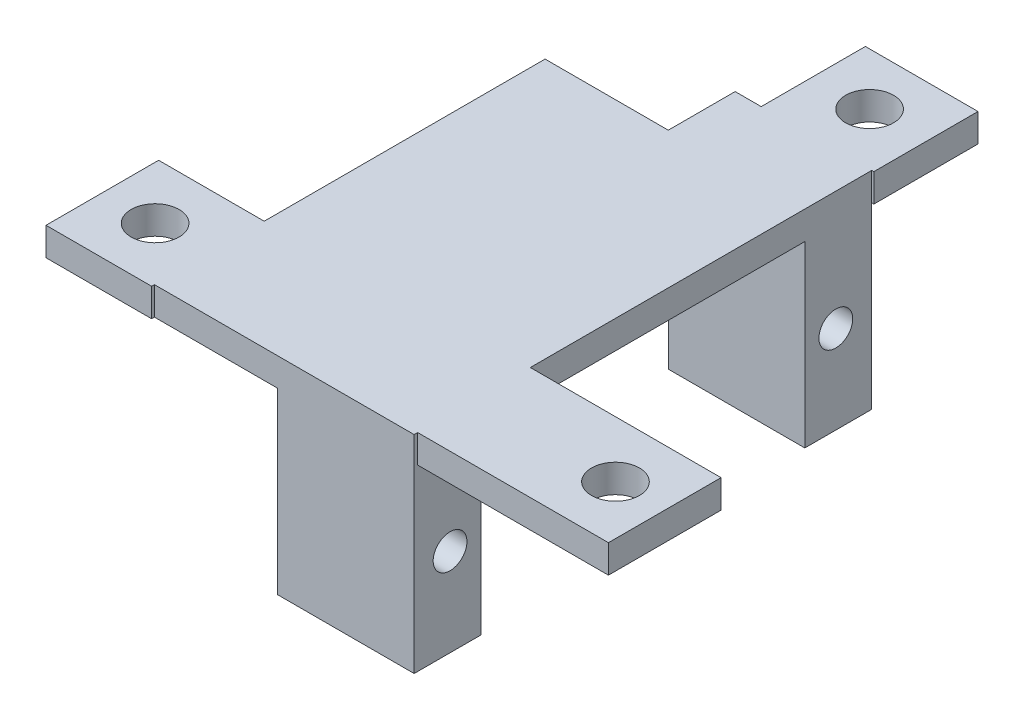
ISO-10303-21;
HEADER;
FILE_DESCRIPTION(('STEP AP214'),'2;1');
FILE_NAME('part.step','',(''),(''),'','','');
FILE_SCHEMA(('AUTOMOTIVE_DESIGN { 1 0 10303 214 1 1 1 1 }'));
ENDSEC;
DATA;
#1=APPLICATION_CONTEXT('core data for automotive mechanical design processes');
#2=APPLICATION_PROTOCOL_DEFINITION('international standard','automotive_design',2000,#1);
#3=PRODUCT_CONTEXT('',#1,'mechanical');
#4=PRODUCT('Part','Part','',(#3));
#5=PRODUCT_RELATED_PRODUCT_CATEGORY('part','',(#4));
#6=PRODUCT_DEFINITION_FORMATION('','',#4);
#7=PRODUCT_DEFINITION_CONTEXT('part definition',#1,'design');
#8=PRODUCT_DEFINITION('design','',#6,#7);
#9=PRODUCT_DEFINITION_SHAPE('','',#8);
#10=(LENGTH_UNIT() NAMED_UNIT(*) SI_UNIT(.MILLI.,.METRE.));
#11=(NAMED_UNIT(*) PLANE_ANGLE_UNIT() SI_UNIT($,.RADIAN.));
#12=(NAMED_UNIT(*) SI_UNIT($,.STERADIAN.) SOLID_ANGLE_UNIT());
#13=UNCERTAINTY_MEASURE_WITH_UNIT(LENGTH_MEASURE(1.E-05),#10,'distance_accuracy_value','');
#14=(GEOMETRIC_REPRESENTATION_CONTEXT(3) GLOBAL_UNCERTAINTY_ASSIGNED_CONTEXT((#13)) GLOBAL_UNIT_ASSIGNED_CONTEXT((#10,
#11,#12)) REPRESENTATION_CONTEXT('',''));
#15=CARTESIAN_POINT('',(0.,0.,0.));
#16=DIRECTION('',(0.,0.,1.));
#17=DIRECTION('',(1.,0.,0.));
#18=AXIS2_PLACEMENT_3D('',#15,#16,#17);
#19=CARTESIAN_POINT('',(0.,0.,0.));
#20=DIRECTION('',(0.,1.,0.));
#21=DIRECTION('',(0.,0.,1.));
#22=AXIS2_PLACEMENT_3D('',#19,#20,#21);
#23=PLANE('',#22);
#24=CARTESIAN_POINT('',(11.,0.,12.));
#25=DIRECTION('',(0.,1.,0.));
#26=DIRECTION('',(0.,0.,1.));
#27=AXIS2_PLACEMENT_3D('',#24,#25,#26);
#28=CIRCLE('',#27,1.7);
#29=CARTESIAN_POINT('',(11.,0.,13.7));
#30=VERTEX_POINT('',#29);
#31=EDGE_CURVE('E297',#30,#30,#28,.T.);
#32=ORIENTED_EDGE('',*,*,#31,.T.);
#33=EDGE_LOOP('',(#32));
#34=FACE_BOUND('',#33,.T.);
#35=CARTESIAN_POINT('',(-21.25,0.,12.45));
#36=DIRECTION('',(0.,1.,0.));
#37=DIRECTION('',(0.,0.,1.));
#38=AXIS2_PLACEMENT_3D('',#35,#36,#37);
#39=CIRCLE('',#38,1.7);
#40=CARTESIAN_POINT('',(-21.25,0.,14.15));
#41=VERTEX_POINT('',#40);
#42=EDGE_CURVE('E855',#41,#41,#39,.T.);
#43=ORIENTED_EDGE('',*,*,#42,.T.);
#44=EDGE_LOOP('',(#43));
#45=FACE_BOUND('',#44,.T.);
#46=DIRECTION('',(0.,0.,-1.));
#47=VECTOR('',#46,1.);
#48=CARTESIAN_POINT('',(-8.75,0.,0.));
#49=LINE('',#48,#47);
#50=CARTESIAN_POINT('',(-8.75,0.,16.25));
#51=VERTEX_POINT('',#50);
#52=CARTESIAN_POINT('',(-8.75,0.,11.5));
#53=VERTEX_POINT('',#52);
#54=EDGE_CURVE('E282',#51,#53,#49,.T.);
#55=ORIENTED_EDGE('',*,*,#54,.F.);
#56=DIRECTION('',(1.,0.,0.));
#57=VECTOR('',#56,1.);
#58=CARTESIAN_POINT('',(0.,0.,16.25));
#59=LINE('',#58,#57);
#60=CARTESIAN_POINT('',(-17.5,0.,16.25));
#61=VERTEX_POINT('',#60);
#62=EDGE_CURVE('E197',#61,#51,#59,.T.);
#63=ORIENTED_EDGE('',*,*,#62,.F.);
#64=DIRECTION('',(0.,0.,-1.));
#65=VECTOR('',#64,1.);
#66=CARTESIAN_POINT('',(-17.5,0.,0.));
#67=LINE('',#66,#65);
#68=CARTESIAN_POINT('',(-17.5,0.,16.45));
#69=VERTEX_POINT('',#68);
#70=EDGE_CURVE('E194',#69,#61,#67,.T.);
#71=ORIENTED_EDGE('',*,*,#70,.F.);
#72=DIRECTION('',(-1.,0.,0.));
#73=VECTOR('',#72,1.);
#74=CARTESIAN_POINT('',(0.,0.,16.45));
#75=LINE('',#74,#73);
#76=CARTESIAN_POINT('',(-25.,0.,16.45));
#77=VERTEX_POINT('',#76);
#78=EDGE_CURVE('E192',#69,#77,#75,.T.);
#79=ORIENTED_EDGE('',*,*,#78,.T.);
#80=DIRECTION('',(0.,0.,-1.));
#81=VECTOR('',#80,1.);
#82=CARTESIAN_POINT('',(-25.,0.,0.));
#83=LINE('',#82,#81);
#84=CARTESIAN_POINT('',(-25.,0.,8.45));
#85=VERTEX_POINT('',#84);
#86=EDGE_CURVE('E229',#77,#85,#83,.T.);
#87=ORIENTED_EDGE('',*,*,#86,.T.);
#88=DIRECTION('',(1.,0.,0.));
#89=VECTOR('',#88,1.);
#90=CARTESIAN_POINT('',(0.,0.,8.45));
#91=LINE('',#90,#89);
#92=CARTESIAN_POINT('',(-17.5,0.,8.45));
#93=VERTEX_POINT('',#92);
#94=EDGE_CURVE('E227',#85,#93,#91,.T.);
#95=ORIENTED_EDGE('',*,*,#94,.T.);
#96=DIRECTION('',(0.,0.,-1.));
#97=VECTOR('',#96,1.);
#98=CARTESIAN_POINT('',(-17.5,0.,0.));
#99=LINE('',#98,#97);
#100=CARTESIAN_POINT('',(-17.5,0.,-11.5));
#101=VERTEX_POINT('',#100);
#102=EDGE_CURVE('E168',#93,#101,#99,.T.);
#103=ORIENTED_EDGE('',*,*,#102,.T.);
#104=DIRECTION('',(-1.,0.,0.));
#105=VECTOR('',#104,1.);
#106=CARTESIAN_POINT('',(0.,0.,-11.5));
#107=LINE('',#106,#105);
#108=CARTESIAN_POINT('',(-8.75,0.,-11.5));
#109=VERTEX_POINT('',#108);
#110=EDGE_CURVE('E223',#109,#101,#107,.T.);
#111=ORIENTED_EDGE('',*,*,#110,.F.);
#112=DIRECTION('',(1.,0.,0.));
#113=VECTOR('',#112,1.);
#114=CARTESIAN_POINT('',(0.,0.,-11.5));
#115=LINE('',#114,#113);
#116=CARTESIAN_POINT('',(0.950000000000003,0.,-11.5));
#117=VERTEX_POINT('',#116);
#118=EDGE_CURVE('E317',#109,#117,#115,.T.);
#119=ORIENTED_EDGE('',*,*,#118,.T.);
#120=DIRECTION('',(0.,0.,1.));
#121=VECTOR('',#120,1.);
#122=CARTESIAN_POINT('',(0.950000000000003,0.,0.));
#123=LINE('',#122,#121);
#124=CARTESIAN_POINT('',(0.950000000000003,0.,8.));
#125=VERTEX_POINT('',#124);
#126=EDGE_CURVE('E209',#117,#125,#123,.T.);
#127=ORIENTED_EDGE('',*,*,#126,.T.);
#128=DIRECTION('',(1.,0.,0.));
#129=VECTOR('',#128,1.);
#130=CARTESIAN_POINT('',(0.,0.,8.));
#131=LINE('',#130,#129);
#132=CARTESIAN_POINT('',(14.5,0.,8.));
#133=VERTEX_POINT('',#132);
#134=EDGE_CURVE('E206',#125,#133,#131,.T.);
#135=ORIENTED_EDGE('',*,*,#134,.T.);
#136=DIRECTION('',(0.,0.,1.));
#137=VECTOR('',#136,1.);
#138=CARTESIAN_POINT('',(14.5,0.,0.));
#139=LINE('',#138,#137);
#140=CARTESIAN_POINT('',(14.5,0.,16.));
#141=VERTEX_POINT('',#140);
#142=EDGE_CURVE('E203',#133,#141,#139,.T.);
#143=ORIENTED_EDGE('',*,*,#142,.T.);
#144=DIRECTION('',(-1.,0.,0.));
#145=VECTOR('',#144,1.);
#146=CARTESIAN_POINT('',(0.,0.,16.));
#147=LINE('',#146,#145);
#148=CARTESIAN_POINT('',(0.950000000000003,0.,16.));
#149=VERTEX_POINT('',#148);
#150=EDGE_CURVE('E200',#141,#149,#147,.T.);
#151=ORIENTED_EDGE('',*,*,#150,.T.);
#152=DIRECTION('',(0.,0.,1.));
#153=VECTOR('',#152,1.);
#154=CARTESIAN_POINT('',(0.950000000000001,0.,0.));
#155=LINE('',#154,#153);
#156=CARTESIAN_POINT('',(0.950000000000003,0.,11.5));
#157=VERTEX_POINT('',#156);
#158=EDGE_CURVE('E294',#157,#149,#155,.T.);
#159=ORIENTED_EDGE('',*,*,#158,.F.);
#160=DIRECTION('',(1.,0.,0.));
#161=VECTOR('',#160,1.);
#162=CARTESIAN_POINT('',(0.,0.,11.5));
#163=LINE('',#162,#161);
#164=EDGE_CURVE('E286',#53,#157,#163,.T.);
#165=ORIENTED_EDGE('',*,*,#164,.F.);
#166=EDGE_LOOP('',(#55,#63,#71,#79,#87,#95,#103,#111,#119,#127,#135,#143,#151,#159,#165));
#167=FACE_BOUND('',#166,.T.);
#168=ADVANCED_FACE('F41',(#34,#45,#167),#23,.F.);
#169=CARTESIAN_POINT('',(-2.9,0.,-19.95));
#170=DIRECTION('',(0.,1.,0.));
#171=DIRECTION('',(0.,0.,1.));
#172=AXIS2_PLACEMENT_3D('',#169,#170,#171);
#173=CIRCLE('',#172,1.7);
#174=CARTESIAN_POINT('',(-2.9,0.,-18.25));
#175=VERTEX_POINT('',#174);
#176=EDGE_CURVE('E292',#175,#175,#173,.T.);
#177=ORIENTED_EDGE('',*,*,#176,.T.);
#178=EDGE_LOOP('',(#177));
#179=FACE_BOUND('',#178,.T.);
#180=DIRECTION('',(1.,0.,0.));
#181=VECTOR('',#180,1.);
#182=CARTESIAN_POINT('',(0.,0.,-16.25));
#183=LINE('',#182,#181);
#184=CARTESIAN_POINT('',(0.949999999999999,0.,-16.25));
#185=VERTEX_POINT('',#184);
#186=CARTESIAN_POINT('',(1.1,0.,-16.25));
#187=VERTEX_POINT('',#186);
#188=EDGE_CURVE('E211',#185,#187,#183,.T.);
#189=ORIENTED_EDGE('',*,*,#188,.F.);
#190=DIRECTION('',(-1.,0.,0.));
#191=VECTOR('',#190,1.);
#192=CARTESIAN_POINT('',(0.,0.,-16.25));
#193=LINE('',#192,#191);
#194=CARTESIAN_POINT('',(-6.9,0.,-16.25));
#195=VERTEX_POINT('',#194);
#196=EDGE_CURVE('E312',#185,#195,#193,.T.);
#197=ORIENTED_EDGE('',*,*,#196,.T.);
#198=DIRECTION('',(0.,0.,-1.));
#199=VECTOR('',#198,1.);
#200=CARTESIAN_POINT('',(-6.9,0.,0.));
#201=LINE('',#200,#199);
#202=CARTESIAN_POINT('',(-6.9,0.,-23.65));
#203=VERTEX_POINT('',#202);
#204=EDGE_CURVE('E220',#195,#203,#201,.T.);
#205=ORIENTED_EDGE('',*,*,#204,.T.);
#206=DIRECTION('',(1.,0.,0.));
#207=VECTOR('',#206,1.);
#208=CARTESIAN_POINT('',(0.,0.,-23.65));
#209=LINE('',#208,#207);
#210=CARTESIAN_POINT('',(1.1,0.,-23.65));
#211=VERTEX_POINT('',#210);
#212=EDGE_CURVE('E217',#203,#211,#209,.T.);
#213=ORIENTED_EDGE('',*,*,#212,.T.);
#214=DIRECTION('',(0.,0.,1.));
#215=VECTOR('',#214,1.);
#216=CARTESIAN_POINT('',(1.1,0.,0.));
#217=LINE('',#216,#215);
#218=EDGE_CURVE('E214',#211,#187,#217,.T.);
#219=ORIENTED_EDGE('',*,*,#218,.T.);
#220=EDGE_LOOP('',(#189,#197,#205,#213,#219));
#221=FACE_BOUND('',#220,.T.);
#222=ADVANCED_FACE('F382',(#179,#221),#23,.F.);
#223=CARTESIAN_POINT('',(0.,2.,16.45));
#224=DIRECTION('',(0.,0.,1.));
#225=DIRECTION('',(1.,0.,0.));
#226=AXIS2_PLACEMENT_3D('',#223,#224,#225);
#227=PLANE('',#226);
#228=ORIENTED_EDGE('',*,*,#78,.F.);
#229=DIRECTION('',(0.,-1.,0.));
#230=VECTOR('',#229,1.);
#231=CARTESIAN_POINT('',(-17.5,2.,16.45));
#232=LINE('',#231,#230);
#233=CARTESIAN_POINT('',(-17.5,2.,16.45));
#234=VERTEX_POINT('',#233);
#235=EDGE_CURVE('E11',#234,#69,#232,.T.);
#236=ORIENTED_EDGE('',*,*,#235,.F.);
#237=DIRECTION('',(-1.,0.,0.));
#238=VECTOR('',#237,1.);
#239=CARTESIAN_POINT('',(0.,2.,16.45));
#240=LINE('',#239,#238);
#241=CARTESIAN_POINT('',(-25.,2.,16.45));
#242=VERTEX_POINT('',#241);
#243=EDGE_CURVE('E232',#234,#242,#240,.T.);
#244=ORIENTED_EDGE('',*,*,#243,.T.);
#245=DIRECTION('',(0.,-1.,0.));
#246=VECTOR('',#245,1.);
#247=CARTESIAN_POINT('',(-25.,2.,16.45));
#248=LINE('',#247,#246);
#249=EDGE_CURVE('E65',#242,#77,#248,.T.);
#250=ORIENTED_EDGE('',*,*,#249,.T.);
#251=EDGE_LOOP('',(#228,#236,#244,#250));
#252=FACE_BOUND('',#251,.T.);
#253=ADVANCED_FACE('F43',(#252),#227,.T.);
#254=CARTESIAN_POINT('',(-17.5,2.,0.));
#255=DIRECTION('',(-1.,0.,0.));
#256=DIRECTION('',(0.,0.,1.));
#257=AXIS2_PLACEMENT_3D('',#254,#255,#256);
#258=PLANE('',#257);
#259=ORIENTED_EDGE('',*,*,#70,.T.);
#260=DIRECTION('',(0.,-1.,0.));
#261=VECTOR('',#260,1.);
#262=CARTESIAN_POINT('',(-17.5,2.,16.25));
#263=LINE('',#262,#261);
#264=CARTESIAN_POINT('',(-17.5,2.,16.25));
#265=VERTEX_POINT('',#264);
#266=EDGE_CURVE('E49',#265,#61,#263,.T.);
#267=ORIENTED_EDGE('',*,*,#266,.F.);
#268=DIRECTION('',(0.,0.,-1.));
#269=VECTOR('',#268,1.);
#270=CARTESIAN_POINT('',(-17.5,2.,0.));
#271=LINE('',#270,#269);
#272=EDGE_CURVE('E335',#234,#265,#271,.T.);
#273=ORIENTED_EDGE('',*,*,#272,.F.);
#274=ORIENTED_EDGE('',*,*,#235,.T.);
#275=EDGE_LOOP('',(#259,#267,#273,#274));
#276=FACE_BOUND('',#275,.T.);
#277=ADVANCED_FACE('F381',(#276),#258,.F.);
#278=CARTESIAN_POINT('',(0.,2.,16.25));
#279=DIRECTION('',(0.,0.,-1.));
#280=DIRECTION('',(-1.,0.,0.));
#281=AXIS2_PLACEMENT_3D('',#278,#279,#280);
#282=PLANE('',#281);
#283=ORIENTED_EDGE('',*,*,#62,.T.);
#284=DIRECTION('',(0.,1.,0.));
#285=VECTOR('',#284,1.);
#286=CARTESIAN_POINT('',(-8.75,-12.7,16.25));
#287=LINE('',#286,#285);
#288=CARTESIAN_POINT('',(-8.75,-12.7,16.25));
#289=VERTEX_POINT('',#288);
#290=EDGE_CURVE('E310',#289,#51,#287,.T.);
#291=ORIENTED_EDGE('',*,*,#290,.F.);
#292=DIRECTION('',(-1.,0.,0.));
#293=VECTOR('',#292,1.);
#294=CARTESIAN_POINT('',(0.,-12.7,16.25));
#295=LINE('',#294,#293);
#296=CARTESIAN_POINT('',(0.950000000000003,-12.7,16.25));
#297=VERTEX_POINT('',#296);
#298=EDGE_CURVE('E304',#297,#289,#295,.T.);
#299=ORIENTED_EDGE('',*,*,#298,.F.);
#300=DIRECTION('',(0.,-1.,0.));
#301=VECTOR('',#300,1.);
#302=CARTESIAN_POINT('',(0.950000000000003,2.,16.25));
#303=LINE('',#302,#301);
#304=CARTESIAN_POINT('',(0.950000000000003,2.,16.25));
#305=VERTEX_POINT('',#304);
#306=EDGE_CURVE('E264',#305,#297,#303,.T.);
#307=ORIENTED_EDGE('',*,*,#306,.F.);
#308=DIRECTION('',(1.,0.,0.));
#309=VECTOR('',#308,1.);
#310=CARTESIAN_POINT('',(0.,2.,16.25));
#311=LINE('',#310,#309);
#312=EDGE_CURVE('E275',#265,#305,#311,.T.);
#313=ORIENTED_EDGE('',*,*,#312,.F.);
#314=ORIENTED_EDGE('',*,*,#266,.T.);
#315=EDGE_LOOP('',(#283,#291,#299,#307,#313,#314));
#316=FACE_BOUND('',#315,.T.);
#317=ADVANCED_FACE('F271',(#316),#282,.F.);
#318=CARTESIAN_POINT('',(0.950000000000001,2.,0.));
#319=DIRECTION('',(-1.,0.,0.));
#320=DIRECTION('',(0.,0.,1.));
#321=AXIS2_PLACEMENT_3D('',#318,#319,#320);
#322=PLANE('',#321);
#323=CARTESIAN_POINT('',(0.950000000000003,-6.45,13.7));
#324=DIRECTION('',(-1.,0.,0.));
#325=DIRECTION('',(0.,0.,1.));
#326=AXIS2_PLACEMENT_3D('',#323,#324,#325);
#327=CIRCLE('',#326,1.2);
#328=CARTESIAN_POINT('',(0.950000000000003,-6.45,14.9));
#329=VERTEX_POINT('',#328);
#330=EDGE_CURVE('E838',#329,#329,#327,.T.);
#331=ORIENTED_EDGE('',*,*,#330,.T.);
#332=EDGE_LOOP('',(#331));
#333=FACE_BOUND('',#332,.T.);
#334=ORIENTED_EDGE('',*,*,#306,.T.);
#335=DIRECTION('',(0.,0.,1.));
#336=VECTOR('',#335,1.);
#337=CARTESIAN_POINT('',(0.950000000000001,-12.7,0.));
#338=LINE('',#337,#336);
#339=CARTESIAN_POINT('',(0.950000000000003,-12.7,11.5));
#340=VERTEX_POINT('',#339);
#341=EDGE_CURVE('E300',#340,#297,#338,.T.);
#342=ORIENTED_EDGE('',*,*,#341,.F.);
#343=DIRECTION('',(0.,1.,0.));
#344=VECTOR('',#343,1.);
#345=CARTESIAN_POINT('',(0.950000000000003,-12.7,11.5));
#346=LINE('',#345,#344);
#347=EDGE_CURVE('E305',#340,#157,#346,.T.);
#348=ORIENTED_EDGE('',*,*,#347,.T.);
#349=ORIENTED_EDGE('',*,*,#158,.T.);
#350=DIRECTION('',(0.,-1.,0.));
#351=VECTOR('',#350,1.);
#352=CARTESIAN_POINT('',(0.950000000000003,2.,16.));
#353=LINE('',#352,#351);
#354=CARTESIAN_POINT('',(0.950000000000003,2.,16.));
#355=VERTEX_POINT('',#354);
#356=EDGE_CURVE('E261',#355,#149,#353,.T.);
#357=ORIENTED_EDGE('',*,*,#356,.F.);
#358=DIRECTION('',(0.,0.,-1.));
#359=VECTOR('',#358,1.);
#360=CARTESIAN_POINT('',(0.950000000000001,2.,0.));
#361=LINE('',#360,#359);
#362=EDGE_CURVE('E338',#305,#355,#361,.T.);
#363=ORIENTED_EDGE('',*,*,#362,.F.);
#364=EDGE_LOOP('',(#334,#342,#348,#349,#357,#363));
#365=FACE_BOUND('',#364,.T.);
#366=ADVANCED_FACE('F443',(#333,#365),#322,.F.);
#367=CARTESIAN_POINT('',(0.,2.,16.));
#368=DIRECTION('',(0.,0.,1.));
#369=DIRECTION('',(1.,0.,0.));
#370=AXIS2_PLACEMENT_3D('',#367,#368,#369);
#371=PLANE('',#370);
#372=ORIENTED_EDGE('',*,*,#150,.F.);
#373=DIRECTION('',(0.,-1.,0.));
#374=VECTOR('',#373,1.);
#375=CARTESIAN_POINT('',(14.5,2.,16.));
#376=LINE('',#375,#374);
#377=CARTESIAN_POINT('',(14.5,2.,16.));
#378=VERTEX_POINT('',#377);
#379=EDGE_CURVE('E259',#378,#141,#376,.T.);
#380=ORIENTED_EDGE('',*,*,#379,.F.);
#381=DIRECTION('',(-1.,0.,0.));
#382=VECTOR('',#381,1.);
#383=CARTESIAN_POINT('',(0.,2.,16.));
#384=LINE('',#383,#382);
#385=EDGE_CURVE('E340',#378,#355,#384,.T.);
#386=ORIENTED_EDGE('',*,*,#385,.T.);
#387=ORIENTED_EDGE('',*,*,#356,.T.);
#388=EDGE_LOOP('',(#372,#380,#386,#387));
#389=FACE_BOUND('',#388,.T.);
#390=ADVANCED_FACE('F439',(#389),#371,.T.);
#391=CARTESIAN_POINT('',(14.5,2.,0.));
#392=DIRECTION('',(1.,0.,0.));
#393=DIRECTION('',(0.,0.,-1.));
#394=AXIS2_PLACEMENT_3D('',#391,#392,#393);
#395=PLANE('',#394);
#396=ORIENTED_EDGE('',*,*,#142,.F.);
#397=DIRECTION('',(0.,-1.,0.));
#398=VECTOR('',#397,1.);
#399=CARTESIAN_POINT('',(14.5,2.,8.));
#400=LINE('',#399,#398);
#401=CARTESIAN_POINT('',(14.5,2.,8.));
#402=VERTEX_POINT('',#401);
#403=EDGE_CURVE('E257',#402,#133,#400,.T.);
#404=ORIENTED_EDGE('',*,*,#403,.F.);
#405=DIRECTION('',(0.,0.,1.));
#406=VECTOR('',#405,1.);
#407=CARTESIAN_POINT('',(14.5,2.,0.));
#408=LINE('',#407,#406);
#409=EDGE_CURVE('E343',#402,#378,#408,.T.);
#410=ORIENTED_EDGE('',*,*,#409,.T.);
#411=ORIENTED_EDGE('',*,*,#379,.T.);
#412=EDGE_LOOP('',(#396,#404,#410,#411));
#413=FACE_BOUND('',#412,.T.);
#414=ADVANCED_FACE('F435',(#413),#395,.T.);
#415=CARTESIAN_POINT('',(0.,2.,8.));
#416=DIRECTION('',(0.,0.,-1.));
#417=DIRECTION('',(-1.,0.,0.));
#418=AXIS2_PLACEMENT_3D('',#415,#416,#417);
#419=PLANE('',#418);
#420=ORIENTED_EDGE('',*,*,#134,.F.);
#421=DIRECTION('',(0.,-1.,0.));
#422=VECTOR('',#421,1.);
#423=CARTESIAN_POINT('',(0.950000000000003,2.,8.));
#424=LINE('',#423,#422);
#425=CARTESIAN_POINT('',(0.950000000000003,2.,8.));
#426=VERTEX_POINT('',#425);
#427=EDGE_CURVE('E254',#426,#125,#424,.T.);
#428=ORIENTED_EDGE('',*,*,#427,.F.);
#429=DIRECTION('',(1.,0.,0.));
#430=VECTOR('',#429,1.);
#431=CARTESIAN_POINT('',(0.,2.,8.));
#432=LINE('',#431,#430);
#433=EDGE_CURVE('E346',#426,#402,#432,.T.);
#434=ORIENTED_EDGE('',*,*,#433,.T.);
#435=ORIENTED_EDGE('',*,*,#403,.T.);
#436=EDGE_LOOP('',(#420,#428,#434,#435));
#437=FACE_BOUND('',#436,.T.);
#438=ADVANCED_FACE('F431',(#437),#419,.T.);
#439=CARTESIAN_POINT('',(0.950000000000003,2.,0.));
#440=DIRECTION('',(1.,0.,0.));
#441=DIRECTION('',(0.,0.,-1.));
#442=AXIS2_PLACEMENT_3D('',#439,#440,#441);
#443=PLANE('',#442);
#444=CARTESIAN_POINT('',(0.95,-6.45,-13.7));
#445=DIRECTION('',(-1.,0.,0.));
#446=DIRECTION('',(0.,0.,1.));
#447=AXIS2_PLACEMENT_3D('',#444,#445,#446);
#448=CIRCLE('',#447,1.2);
#449=CARTESIAN_POINT('',(0.95,-6.45,-12.5));
#450=VERTEX_POINT('',#449);
#451=EDGE_CURVE('E844',#450,#450,#448,.T.);
#452=ORIENTED_EDGE('',*,*,#451,.T.);
#453=EDGE_LOOP('',(#452));
#454=FACE_BOUND('',#453,.T.);
#455=ORIENTED_EDGE('',*,*,#126,.F.);
#456=DIRECTION('',(0.,1.,0.));
#457=VECTOR('',#456,1.);
#458=CARTESIAN_POINT('',(0.950000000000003,-12.7,-11.5));
#459=LINE('',#458,#457);
#460=CARTESIAN_POINT('',(0.950000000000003,-12.7,-11.5));
#461=VERTEX_POINT('',#460);
#462=EDGE_CURVE('E56',#461,#117,#459,.T.);
#463=ORIENTED_EDGE('',*,*,#462,.F.);
#464=DIRECTION('',(0.,0.,-1.));
#465=VECTOR('',#464,1.);
#466=CARTESIAN_POINT('',(0.950000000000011,-12.7,0.));
#467=LINE('',#466,#465);
#468=CARTESIAN_POINT('',(0.949999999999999,-12.7,-16.25));
#469=VERTEX_POINT('',#468);
#470=EDGE_CURVE('E322',#461,#469,#467,.T.);
#471=ORIENTED_EDGE('',*,*,#470,.T.);
#472=DIRECTION('',(0.,1.,0.));
#473=VECTOR('',#472,1.);
#474=CARTESIAN_POINT('',(0.949999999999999,-12.7,-16.25));
#475=LINE('',#474,#473);
#476=EDGE_CURVE('E195',#469,#185,#475,.T.);
#477=ORIENTED_EDGE('',*,*,#476,.T.);
#478=DIRECTION('',(0.,-1.,0.));
#479=VECTOR('',#478,1.);
#480=CARTESIAN_POINT('',(0.949999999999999,2.,-16.25));
#481=LINE('',#480,#479);
#482=CARTESIAN_POINT('',(0.949999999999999,2.,-16.25));
#483=VERTEX_POINT('',#482);
#484=EDGE_CURVE('E251',#483,#185,#481,.T.);
#485=ORIENTED_EDGE('',*,*,#484,.F.);
#486=DIRECTION('',(0.,0.,1.));
#487=VECTOR('',#486,1.);
#488=CARTESIAN_POINT('',(0.950000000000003,2.,0.));
#489=LINE('',#488,#487);
#490=EDGE_CURVE('E349',#483,#426,#489,.T.);
#491=ORIENTED_EDGE('',*,*,#490,.T.);
#492=ORIENTED_EDGE('',*,*,#427,.T.);
#493=EDGE_LOOP('',(#455,#463,#471,#477,#485,#491,#492));
#494=FACE_BOUND('',#493,.T.);
#495=ADVANCED_FACE('F427',(#454,#494),#443,.T.);
#496=CARTESIAN_POINT('',(0.,2.,-16.25));
#497=DIRECTION('',(0.,0.,-1.));
#498=DIRECTION('',(-1.,0.,0.));
#499=AXIS2_PLACEMENT_3D('',#496,#497,#498);
#500=PLANE('',#499);
#501=ORIENTED_EDGE('',*,*,#188,.T.);
#502=DIRECTION('',(0.,-1.,0.));
#503=VECTOR('',#502,1.);
#504=CARTESIAN_POINT('',(1.1,2.,-16.25));
#505=LINE('',#504,#503);
#506=CARTESIAN_POINT('',(1.1,2.,-16.25));
#507=VERTEX_POINT('',#506);
#508=EDGE_CURVE('E249',#507,#187,#505,.T.);
#509=ORIENTED_EDGE('',*,*,#508,.F.);
#510=DIRECTION('',(1.,0.,0.));
#511=VECTOR('',#510,1.);
#512=CARTESIAN_POINT('',(0.,2.,-16.25));
#513=LINE('',#512,#511);
#514=EDGE_CURVE('E352',#483,#507,#513,.T.);
#515=ORIENTED_EDGE('',*,*,#514,.F.);
#516=ORIENTED_EDGE('',*,*,#484,.T.);
#517=EDGE_LOOP('',(#501,#509,#515,#516));
#518=FACE_BOUND('',#517,.T.);
#519=ADVANCED_FACE('F423',(#518),#500,.F.);
#520=CARTESIAN_POINT('',(1.1,2.,0.));
#521=DIRECTION('',(1.,0.,0.));
#522=DIRECTION('',(0.,0.,-1.));
#523=AXIS2_PLACEMENT_3D('',#520,#521,#522);
#524=PLANE('',#523);
#525=ORIENTED_EDGE('',*,*,#218,.F.);
#526=DIRECTION('',(0.,-1.,0.));
#527=VECTOR('',#526,1.);
#528=CARTESIAN_POINT('',(1.1,2.,-23.65));
#529=LINE('',#528,#527);
#530=CARTESIAN_POINT('',(1.1,2.,-23.65));
#531=VERTEX_POINT('',#530);
#532=EDGE_CURVE('E247',#531,#211,#529,.T.);
#533=ORIENTED_EDGE('',*,*,#532,.F.);
#534=DIRECTION('',(0.,0.,1.));
#535=VECTOR('',#534,1.);
#536=CARTESIAN_POINT('',(1.1,2.,0.));
#537=LINE('',#536,#535);
#538=EDGE_CURVE('E354',#531,#507,#537,.T.);
#539=ORIENTED_EDGE('',*,*,#538,.T.);
#540=ORIENTED_EDGE('',*,*,#508,.T.);
#541=EDGE_LOOP('',(#525,#533,#539,#540));
#542=FACE_BOUND('',#541,.T.);
#543=ADVANCED_FACE('F419',(#542),#524,.T.);
#544=CARTESIAN_POINT('',(0.,2.,-23.65));
#545=DIRECTION('',(0.,0.,-1.));
#546=DIRECTION('',(-1.,0.,0.));
#547=AXIS2_PLACEMENT_3D('',#544,#545,#546);
#548=PLANE('',#547);
#549=ORIENTED_EDGE('',*,*,#212,.F.);
#550=DIRECTION('',(0.,-1.,0.));
#551=VECTOR('',#550,1.);
#552=CARTESIAN_POINT('',(-6.9,2.,-23.65));
#553=LINE('',#552,#551);
#554=CARTESIAN_POINT('',(-6.9,2.,-23.65));
#555=VERTEX_POINT('',#554);
#556=EDGE_CURVE('E245',#555,#203,#553,.T.);
#557=ORIENTED_EDGE('',*,*,#556,.F.);
#558=DIRECTION('',(1.,0.,0.));
#559=VECTOR('',#558,1.);
#560=CARTESIAN_POINT('',(0.,2.,-23.65));
#561=LINE('',#560,#559);
#562=EDGE_CURVE('E357',#555,#531,#561,.T.);
#563=ORIENTED_EDGE('',*,*,#562,.T.);
#564=ORIENTED_EDGE('',*,*,#532,.T.);
#565=EDGE_LOOP('',(#549,#557,#563,#564));
#566=FACE_BOUND('',#565,.T.);
#567=ADVANCED_FACE('F415',(#566),#548,.T.);
#568=CARTESIAN_POINT('',(-6.9,2.,0.));
#569=DIRECTION('',(-1.,0.,0.));
#570=DIRECTION('',(0.,0.,1.));
#571=AXIS2_PLACEMENT_3D('',#568,#569,#570);
#572=PLANE('',#571);
#573=ORIENTED_EDGE('',*,*,#204,.F.);
#574=DIRECTION('',(0.,-1.,0.));
#575=VECTOR('',#574,1.);
#576=CARTESIAN_POINT('',(-6.9,2.,-16.25));
#577=LINE('',#576,#575);
#578=CARTESIAN_POINT('',(-6.9,2.,-16.25));
#579=VERTEX_POINT('',#578);
#580=EDGE_CURVE('E242',#579,#195,#577,.T.);
#581=ORIENTED_EDGE('',*,*,#580,.F.);
#582=DIRECTION('',(0.,0.,-1.));
#583=VECTOR('',#582,1.);
#584=CARTESIAN_POINT('',(-6.9,2.,0.));
#585=LINE('',#584,#583);
#586=EDGE_CURVE('E360',#579,#555,#585,.T.);
#587=ORIENTED_EDGE('',*,*,#586,.T.);
#588=ORIENTED_EDGE('',*,*,#556,.T.);
#589=EDGE_LOOP('',(#573,#581,#587,#588));
#590=FACE_BOUND('',#589,.T.);
#591=ADVANCED_FACE('F411',(#590),#572,.T.);
#592=CARTESIAN_POINT('',(0.,2.,-16.25));
#593=DIRECTION('',(0.,0.,-1.));
#594=DIRECTION('',(-1.,0.,0.));
#595=AXIS2_PLACEMENT_3D('',#592,#593,#594);
#596=PLANE('',#595);
#597=ORIENTED_EDGE('',*,*,#580,.T.);
#598=ORIENTED_EDGE('',*,*,#196,.F.);
#599=ORIENTED_EDGE('',*,*,#476,.F.);
#600=DIRECTION('',(-1.,0.,0.));
#601=VECTOR('',#600,1.);
#602=CARTESIAN_POINT('',(0.,-12.7,-16.25));
#603=LINE('',#602,#601);
#604=CARTESIAN_POINT('',(-8.75,-12.7,-16.25));
#605=VERTEX_POINT('',#604);
#606=EDGE_CURVE('E313',#469,#605,#603,.T.);
#607=ORIENTED_EDGE('',*,*,#606,.T.);
#608=DIRECTION('',(0.,-1.,0.));
#609=VECTOR('',#608,1.);
#610=CARTESIAN_POINT('',(-8.75,2.,-16.25));
#611=LINE('',#610,#609);
#612=CARTESIAN_POINT('',(-8.75,2.,-16.25));
#613=VERTEX_POINT('',#612);
#614=EDGE_CURVE('E239',#613,#605,#611,.T.);
#615=ORIENTED_EDGE('',*,*,#614,.F.);
#616=DIRECTION('',(1.,0.,0.));
#617=VECTOR('',#616,1.);
#618=CARTESIAN_POINT('',(0.,2.,-16.25));
#619=LINE('',#618,#617);
#620=EDGE_CURVE('E363',#613,#579,#619,.T.);
#621=ORIENTED_EDGE('',*,*,#620,.T.);
#622=EDGE_LOOP('',(#597,#598,#599,#607,#615,#621));
#623=FACE_BOUND('',#622,.T.);
#624=ADVANCED_FACE('F408',(#623),#596,.T.);
#625=CARTESIAN_POINT('',(-8.75,2.,0.));
#626=DIRECTION('',(1.,0.,0.));
#627=DIRECTION('',(0.,0.,-1.));
#628=AXIS2_PLACEMENT_3D('',#625,#626,#627);
#629=PLANE('',#628);
#630=ORIENTED_EDGE('',*,*,#614,.T.);
#631=DIRECTION('',(0.,0.,-1.));
#632=VECTOR('',#631,1.);
#633=CARTESIAN_POINT('',(-8.75,-12.7,0.));
#634=LINE('',#633,#632);
#635=CARTESIAN_POINT('',(-8.75,-12.7,-11.5));
#636=VERTEX_POINT('',#635);
#637=EDGE_CURVE('E316',#636,#605,#634,.T.);
#638=ORIENTED_EDGE('',*,*,#637,.F.);
#639=DIRECTION('',(0.,1.,0.));
#640=VECTOR('',#639,1.);
#641=CARTESIAN_POINT('',(-8.75,-12.7,-11.5));
#642=LINE('',#641,#640);
#643=EDGE_CURVE('E325',#636,#109,#642,.T.);
#644=ORIENTED_EDGE('',*,*,#643,.T.);
#645=DIRECTION('',(0.,-1.,0.));
#646=VECTOR('',#645,1.);
#647=CARTESIAN_POINT('',(-8.75,2.,-11.5));
#648=LINE('',#647,#646);
#649=CARTESIAN_POINT('',(-8.75,2.,-11.5));
#650=VERTEX_POINT('',#649);
#651=EDGE_CURVE('E236',#650,#109,#648,.T.);
#652=ORIENTED_EDGE('',*,*,#651,.F.);
#653=DIRECTION('',(0.,0.,1.));
#654=VECTOR('',#653,1.);
#655=CARTESIAN_POINT('',(-8.75,2.,0.));
#656=LINE('',#655,#654);
#657=EDGE_CURVE('E366',#613,#650,#656,.T.);
#658=ORIENTED_EDGE('',*,*,#657,.F.);
#659=EDGE_LOOP('',(#630,#638,#644,#652,#658));
#660=FACE_BOUND('',#659,.T.);
#661=ADVANCED_FACE('F372',(#660),#629,.F.);
#662=CARTESIAN_POINT('',(0.,2.,-11.5));
#663=DIRECTION('',(0.,0.,1.));
#664=DIRECTION('',(1.,0.,0.));
#665=AXIS2_PLACEMENT_3D('',#662,#663,#664);
#666=PLANE('',#665);
#667=ORIENTED_EDGE('',*,*,#110,.T.);
#668=DIRECTION('',(0.,-1.,0.));
#669=VECTOR('',#668,1.);
#670=CARTESIAN_POINT('',(-17.5,2.,-11.5));
#671=LINE('',#670,#669);
#672=CARTESIAN_POINT('',(-17.5,2.,-11.5));
#673=VERTEX_POINT('',#672);
#674=EDGE_CURVE('E173',#673,#101,#671,.T.);
#675=ORIENTED_EDGE('',*,*,#674,.F.);
#676=DIRECTION('',(-1.,0.,0.));
#677=VECTOR('',#676,1.);
#678=CARTESIAN_POINT('',(0.,2.,-11.5));
#679=LINE('',#678,#677);
#680=EDGE_CURVE('E183',#650,#673,#679,.T.);
#681=ORIENTED_EDGE('',*,*,#680,.F.);
#682=ORIENTED_EDGE('',*,*,#651,.T.);
#683=EDGE_LOOP('',(#667,#675,#681,#682));
#684=FACE_BOUND('',#683,.T.);
#685=ADVANCED_FACE('F378',(#684),#666,.F.);
#686=CARTESIAN_POINT('',(-17.5,2.,0.));
#687=DIRECTION('',(-1.,0.,0.));
#688=DIRECTION('',(0.,0.,1.));
#689=AXIS2_PLACEMENT_3D('',#686,#687,#688);
#690=PLANE('',#689);
#691=ORIENTED_EDGE('',*,*,#102,.F.);
#692=DIRECTION('',(0.,-1.,0.));
#693=VECTOR('',#692,1.);
#694=CARTESIAN_POINT('',(-17.5,2.,8.45));
#695=LINE('',#694,#693);
#696=CARTESIAN_POINT('',(-17.5,2.,8.45));
#697=VERTEX_POINT('',#696);
#698=EDGE_CURVE('E163',#697,#93,#695,.T.);
#699=ORIENTED_EDGE('',*,*,#698,.F.);
#700=DIRECTION('',(0.,0.,-1.));
#701=VECTOR('',#700,1.);
#702=CARTESIAN_POINT('',(-17.5,2.,0.));
#703=LINE('',#702,#701);
#704=EDGE_CURVE('E166',#697,#673,#703,.T.);
#705=ORIENTED_EDGE('',*,*,#704,.T.);
#706=ORIENTED_EDGE('',*,*,#674,.T.);
#707=EDGE_LOOP('',(#691,#699,#705,#706));
#708=FACE_BOUND('',#707,.T.);
#709=ADVANCED_FACE('F165',(#708),#690,.T.);
#710=CARTESIAN_POINT('',(0.,2.,8.45));
#711=DIRECTION('',(0.,0.,-1.));
#712=DIRECTION('',(-1.,0.,0.));
#713=AXIS2_PLACEMENT_3D('',#710,#711,#712);
#714=PLANE('',#713);
#715=ORIENTED_EDGE('',*,*,#94,.F.);
#716=DIRECTION('',(0.,-1.,0.));
#717=VECTOR('',#716,1.);
#718=CARTESIAN_POINT('',(-25.,2.,8.45));
#719=LINE('',#718,#717);
#720=CARTESIAN_POINT('',(-25.,2.,8.45));
#721=VERTEX_POINT('',#720);
#722=EDGE_CURVE('E174',#721,#85,#719,.T.);
#723=ORIENTED_EDGE('',*,*,#722,.F.);
#724=DIRECTION('',(1.,0.,0.));
#725=VECTOR('',#724,1.);
#726=CARTESIAN_POINT('',(0.,2.,8.45));
#727=LINE('',#726,#725);
#728=EDGE_CURVE('E181',#721,#697,#727,.T.);
#729=ORIENTED_EDGE('',*,*,#728,.T.);
#730=ORIENTED_EDGE('',*,*,#698,.T.);
#731=EDGE_LOOP('',(#715,#723,#729,#730));
#732=FACE_BOUND('',#731,.T.);
#733=ADVANCED_FACE('F186',(#732),#714,.T.);
#734=CARTESIAN_POINT('',(-25.,2.,0.));
#735=DIRECTION('',(-1.,0.,0.));
#736=DIRECTION('',(0.,0.,1.));
#737=AXIS2_PLACEMENT_3D('',#734,#735,#736);
#738=PLANE('',#737);
#739=ORIENTED_EDGE('',*,*,#86,.F.);
#740=ORIENTED_EDGE('',*,*,#249,.F.);
#741=DIRECTION('',(0.,0.,-1.));
#742=VECTOR('',#741,1.);
#743=CARTESIAN_POINT('',(-25.,2.,0.));
#744=LINE('',#743,#742);
#745=EDGE_CURVE('E187',#242,#721,#744,.T.);
#746=ORIENTED_EDGE('',*,*,#745,.T.);
#747=ORIENTED_EDGE('',*,*,#722,.T.);
#748=EDGE_LOOP('',(#739,#740,#746,#747));
#749=FACE_BOUND('',#748,.T.);
#750=ADVANCED_FACE('F379',(#749),#738,.T.);
#751=CARTESIAN_POINT('',(0.,2.,0.));
#752=DIRECTION('',(0.,1.,0.));
#753=DIRECTION('',(0.,0.,1.));
#754=AXIS2_PLACEMENT_3D('',#751,#752,#753);
#755=PLANE('',#754);
#756=CARTESIAN_POINT('',(-2.9,2.,-19.95));
#757=DIRECTION('',(0.,1.,0.));
#758=DIRECTION('',(0.,0.,1.));
#759=AXIS2_PLACEMENT_3D('',#756,#757,#758);
#760=CIRCLE('',#759,1.7);
#761=CARTESIAN_POINT('',(-2.9,2.,-18.25));
#762=VERTEX_POINT('',#761);
#763=EDGE_CURVE('E852',#762,#762,#760,.T.);
#764=ORIENTED_EDGE('',*,*,#763,.F.);
#765=EDGE_LOOP('',(#764));
#766=FACE_BOUND('',#765,.T.);
#767=CARTESIAN_POINT('',(11.,2.,12.));
#768=DIRECTION('',(0.,1.,0.));
#769=DIRECTION('',(0.,0.,1.));
#770=AXIS2_PLACEMENT_3D('',#767,#768,#769);
#771=CIRCLE('',#770,1.7);
#772=CARTESIAN_POINT('',(11.,2.,13.7));
#773=VERTEX_POINT('',#772);
#774=EDGE_CURVE('E841',#773,#773,#771,.T.);
#775=ORIENTED_EDGE('',*,*,#774,.F.);
#776=EDGE_LOOP('',(#775));
#777=FACE_BOUND('',#776,.T.);
#778=CARTESIAN_POINT('',(-21.25,2.,12.45));
#779=DIRECTION('',(0.,1.,0.));
#780=DIRECTION('',(0.,0.,1.));
#781=AXIS2_PLACEMENT_3D('',#778,#779,#780);
#782=CIRCLE('',#781,1.7);
#783=CARTESIAN_POINT('',(-21.25,2.,14.15));
#784=VERTEX_POINT('',#783);
#785=EDGE_CURVE('E837',#784,#784,#782,.T.);
#786=ORIENTED_EDGE('',*,*,#785,.F.);
#787=EDGE_LOOP('',(#786));
#788=FACE_BOUND('',#787,.T.);
#789=ORIENTED_EDGE('',*,*,#243,.F.);
#790=ORIENTED_EDGE('',*,*,#272,.T.);
#791=ORIENTED_EDGE('',*,*,#312,.T.);
#792=ORIENTED_EDGE('',*,*,#362,.T.);
#793=ORIENTED_EDGE('',*,*,#385,.F.);
#794=ORIENTED_EDGE('',*,*,#409,.F.);
#795=ORIENTED_EDGE('',*,*,#433,.F.);
#796=ORIENTED_EDGE('',*,*,#490,.F.);
#797=ORIENTED_EDGE('',*,*,#514,.T.);
#798=ORIENTED_EDGE('',*,*,#538,.F.);
#799=ORIENTED_EDGE('',*,*,#562,.F.);
#800=ORIENTED_EDGE('',*,*,#586,.F.);
#801=ORIENTED_EDGE('',*,*,#620,.F.);
#802=ORIENTED_EDGE('',*,*,#657,.T.);
#803=ORIENTED_EDGE('',*,*,#680,.T.);
#804=ORIENTED_EDGE('',*,*,#704,.F.);
#805=ORIENTED_EDGE('',*,*,#728,.F.);
#806=ORIENTED_EDGE('',*,*,#745,.F.);
#807=EDGE_LOOP('',(#789,#790,#791,#792,#793,#794,#795,#796,#797,#798,#799,#800,#801,#802,#803,
#804,#805,#806));
#808=FACE_BOUND('',#807,.T.);
#809=ADVANCED_FACE('F179',(#766,#777,#788,#808),#755,.T.);
#810=CARTESIAN_POINT('',(0.,-12.7,-11.5));
#811=DIRECTION('',(0.,0.,1.));
#812=DIRECTION('',(1.,0.,0.));
#813=AXIS2_PLACEMENT_3D('',#810,#811,#812);
#814=PLANE('',#813);
#815=ORIENTED_EDGE('',*,*,#118,.F.);
#816=ORIENTED_EDGE('',*,*,#643,.F.);
#817=DIRECTION('',(1.,0.,0.));
#818=VECTOR('',#817,1.);
#819=CARTESIAN_POINT('',(0.,-12.7,-11.5));
#820=LINE('',#819,#818);
#821=EDGE_CURVE('E320',#636,#461,#820,.T.);
#822=ORIENTED_EDGE('',*,*,#821,.T.);
#823=ORIENTED_EDGE('',*,*,#462,.T.);
#824=EDGE_LOOP('',(#815,#816,#822,#823));
#825=FACE_BOUND('',#824,.T.);
#826=ADVANCED_FACE('F522',(#825),#814,.T.);
#827=CARTESIAN_POINT('',(0.,-12.7,0.));
#828=DIRECTION('',(0.,-1.,0.));
#829=DIRECTION('',(0.,0.,-1.));
#830=AXIS2_PLACEMENT_3D('',#827,#828,#829);
#831=PLANE('',#830);
#832=ORIENTED_EDGE('',*,*,#606,.F.);
#833=ORIENTED_EDGE('',*,*,#470,.F.);
#834=ORIENTED_EDGE('',*,*,#821,.F.);
#835=ORIENTED_EDGE('',*,*,#637,.T.);
#836=EDGE_LOOP('',(#832,#833,#834,#835));
#837=FACE_BOUND('',#836,.T.);
#838=ADVANCED_FACE('F530',(#837),#831,.T.);
#839=CARTESIAN_POINT('',(-8.75,-12.7,0.));
#840=DIRECTION('',(1.,0.,0.));
#841=DIRECTION('',(0.,0.,-1.));
#842=AXIS2_PLACEMENT_3D('',#839,#840,#841);
#843=PLANE('',#842);
#844=ORIENTED_EDGE('',*,*,#54,.T.);
#845=DIRECTION('',(0.,1.,0.));
#846=VECTOR('',#845,1.);
#847=CARTESIAN_POINT('',(-8.75,-12.7,11.5));
#848=LINE('',#847,#846);
#849=CARTESIAN_POINT('',(-8.75,-12.7,11.5));
#850=VERTEX_POINT('',#849);
#851=EDGE_CURVE('E308',#850,#53,#848,.T.);
#852=ORIENTED_EDGE('',*,*,#851,.F.);
#853=DIRECTION('',(0.,0.,-1.));
#854=VECTOR('',#853,1.);
#855=CARTESIAN_POINT('',(-8.75,-12.7,0.));
#856=LINE('',#855,#854);
#857=EDGE_CURVE('E863',#289,#850,#856,.T.);
#858=ORIENTED_EDGE('',*,*,#857,.F.);
#859=ORIENTED_EDGE('',*,*,#290,.T.);
#860=EDGE_LOOP('',(#844,#852,#858,#859));
#861=FACE_BOUND('',#860,.T.);
#862=ADVANCED_FACE('F536',(#861),#843,.F.);
#863=CARTESIAN_POINT('',(0.,-12.7,11.5));
#864=DIRECTION('',(0.,0.,1.));
#865=DIRECTION('',(1.,0.,0.));
#866=AXIS2_PLACEMENT_3D('',#863,#864,#865);
#867=PLANE('',#866);
#868=ORIENTED_EDGE('',*,*,#164,.T.);
#869=ORIENTED_EDGE('',*,*,#347,.F.);
#870=DIRECTION('',(1.,0.,0.));
#871=VECTOR('',#870,1.);
#872=CARTESIAN_POINT('',(0.,-12.7,11.5));
#873=LINE('',#872,#871);
#874=EDGE_CURVE('E865',#850,#340,#873,.T.);
#875=ORIENTED_EDGE('',*,*,#874,.F.);
#876=ORIENTED_EDGE('',*,*,#851,.T.);
#877=EDGE_LOOP('',(#868,#869,#875,#876));
#878=FACE_BOUND('',#877,.T.);
#879=ADVANCED_FACE('F544',(#878),#867,.F.);
#880=CARTESIAN_POINT('',(0.,-12.7,0.));
#881=DIRECTION('',(0.,-1.,0.));
#882=DIRECTION('',(0.,0.,-1.));
#883=AXIS2_PLACEMENT_3D('',#880,#881,#882);
#884=PLANE('',#883);
#885=ORIENTED_EDGE('',*,*,#298,.T.);
#886=ORIENTED_EDGE('',*,*,#857,.T.);
#887=ORIENTED_EDGE('',*,*,#874,.T.);
#888=ORIENTED_EDGE('',*,*,#341,.T.);
#889=EDGE_LOOP('',(#885,#886,#887,#888));
#890=FACE_BOUND('',#889,.T.);
#891=ADVANCED_FACE('F551',(#890),#884,.T.);
#892=CARTESIAN_POINT('',(-21.25,-12.7,12.45));
#893=DIRECTION('',(0.,1.,0.));
#894=DIRECTION('',(0.,0.,1.));
#895=AXIS2_PLACEMENT_3D('',#892,#893,#894);
#896=CYLINDRICAL_SURFACE('',#895,1.7);
#897=ORIENTED_EDGE('',*,*,#785,.T.);
#898=EDGE_LOOP('',(#897));
#899=FACE_BOUND('',#898,.T.);
#900=ORIENTED_EDGE('',*,*,#42,.F.);
#901=EDGE_LOOP('',(#900));
#902=FACE_BOUND('',#901,.T.);
#903=ADVANCED_FACE('F559',(#899,#902),#896,.F.);
#904=CARTESIAN_POINT('',(11.,-12.7,12.));
#905=DIRECTION('',(0.,1.,0.));
#906=DIRECTION('',(0.,0.,1.));
#907=AXIS2_PLACEMENT_3D('',#904,#905,#906);
#908=CYLINDRICAL_SURFACE('',#907,1.7);
#909=ORIENTED_EDGE('',*,*,#774,.T.);
#910=EDGE_LOOP('',(#909));
#911=FACE_BOUND('',#910,.T.);
#912=ORIENTED_EDGE('',*,*,#31,.F.);
#913=EDGE_LOOP('',(#912));
#914=FACE_BOUND('',#913,.T.);
#915=ADVANCED_FACE('F566',(#911,#914),#908,.F.);
#916=CARTESIAN_POINT('',(-2.9,-12.7,-19.95));
#917=DIRECTION('',(0.,1.,0.));
#918=DIRECTION('',(0.,0.,1.));
#919=AXIS2_PLACEMENT_3D('',#916,#917,#918);
#920=CYLINDRICAL_SURFACE('',#919,1.7);
#921=ORIENTED_EDGE('',*,*,#763,.T.);
#922=EDGE_LOOP('',(#921));
#923=FACE_BOUND('',#922,.T.);
#924=ORIENTED_EDGE('',*,*,#176,.F.);
#925=EDGE_LOOP('',(#924));
#926=FACE_BOUND('',#925,.T.);
#927=ADVANCED_FACE('F574',(#923,#926),#920,.F.);
#928=CARTESIAN_POINT('',(-7.05,-6.45,-13.7));
#929=DIRECTION('',(1.,0.,0.));
#930=DIRECTION('',(0.,0.,-1.));
#931=AXIS2_PLACEMENT_3D('',#928,#929,#930);
#932=CYLINDRICAL_SURFACE('',#931,1.2);
#933=CARTESIAN_POINT('',(-7.05,-6.45,-13.7));
#934=DIRECTION('',(-1.,0.,0.));
#935=DIRECTION('',(0.,0.,1.));
#936=AXIS2_PLACEMENT_3D('',#933,#934,#935);
#937=CIRCLE('',#936,1.2);
#938=CARTESIAN_POINT('',(-7.05,-6.45,-12.5));
#939=VERTEX_POINT('',#938);
#940=EDGE_CURVE('E849',#939,#939,#937,.T.);
#941=ORIENTED_EDGE('',*,*,#940,.T.);
#942=EDGE_LOOP('',(#941));
#943=FACE_BOUND('',#942,.T.);
#944=ORIENTED_EDGE('',*,*,#451,.F.);
#945=EDGE_LOOP('',(#944));
#946=FACE_BOUND('',#945,.T.);
#947=ADVANCED_FACE('F581',(#943,#946),#932,.F.);
#948=CARTESIAN_POINT('',(-7.05,-6.45,-13.7));
#949=DIRECTION('',(-1.,0.,0.));
#950=DIRECTION('',(0.,0.,1.));
#951=AXIS2_PLACEMENT_3D('',#948,#949,#950);
#952=PLANE('',#951);
#953=ORIENTED_EDGE('',*,*,#940,.F.);
#954=EDGE_LOOP('',(#953));
#955=FACE_BOUND('',#954,.T.);
#956=ADVANCED_FACE('F588',(#955),#952,.F.);
#957=CARTESIAN_POINT('',(-7.05,-6.45,13.7));
#958=DIRECTION('',(1.,0.,0.));
#959=DIRECTION('',(0.,0.,-1.));
#960=AXIS2_PLACEMENT_3D('',#957,#958,#959);
#961=CYLINDRICAL_SURFACE('',#960,1.2);
#962=CARTESIAN_POINT('',(-7.05,-6.45,13.7));
#963=DIRECTION('',(-1.,0.,0.));
#964=DIRECTION('',(0.,0.,1.));
#965=AXIS2_PLACEMENT_3D('',#962,#963,#964);
#966=CIRCLE('',#965,1.2);
#967=CARTESIAN_POINT('',(-7.05,-6.45,14.9));
#968=VERTEX_POINT('',#967);
#969=EDGE_CURVE('E836',#968,#968,#966,.T.);
#970=ORIENTED_EDGE('',*,*,#969,.T.);
#971=EDGE_LOOP('',(#970));
#972=FACE_BOUND('',#971,.T.);
#973=ORIENTED_EDGE('',*,*,#330,.F.);
#974=EDGE_LOOP('',(#973));
#975=FACE_BOUND('',#974,.T.);
#976=ADVANCED_FACE('F596',(#972,#975),#961,.F.);
#977=CARTESIAN_POINT('',(-7.05,-6.45,13.7));
#978=DIRECTION('',(-1.,0.,0.));
#979=DIRECTION('',(0.,0.,1.));
#980=AXIS2_PLACEMENT_3D('',#977,#978,#979);
#981=PLANE('',#980);
#982=ORIENTED_EDGE('',*,*,#969,.F.);
#983=EDGE_LOOP('',(#982));
#984=FACE_BOUND('',#983,.T.);
#985=ADVANCED_FACE('F604',(#984),#981,.F.);
#986=CLOSED_SHELL('',(#168,#222,#253,#277,#317,#366,#390,#414,#438,#495,#519,#543,#567,#591,
#624,#661,#685,#709,#733,#750,#809,#826,#838,#862,#879,#891,#903,#915,#927,#947,#956,#976,#985));
#987=MANIFOLD_SOLID_BREP('B2',#986);
#988=ADVANCED_BREP_SHAPE_REPRESENTATION('',(#18,#987),#14);
#989=SHAPE_DEFINITION_REPRESENTATION(#9,#988);
ENDSEC;
END-ISO-10303-21;
